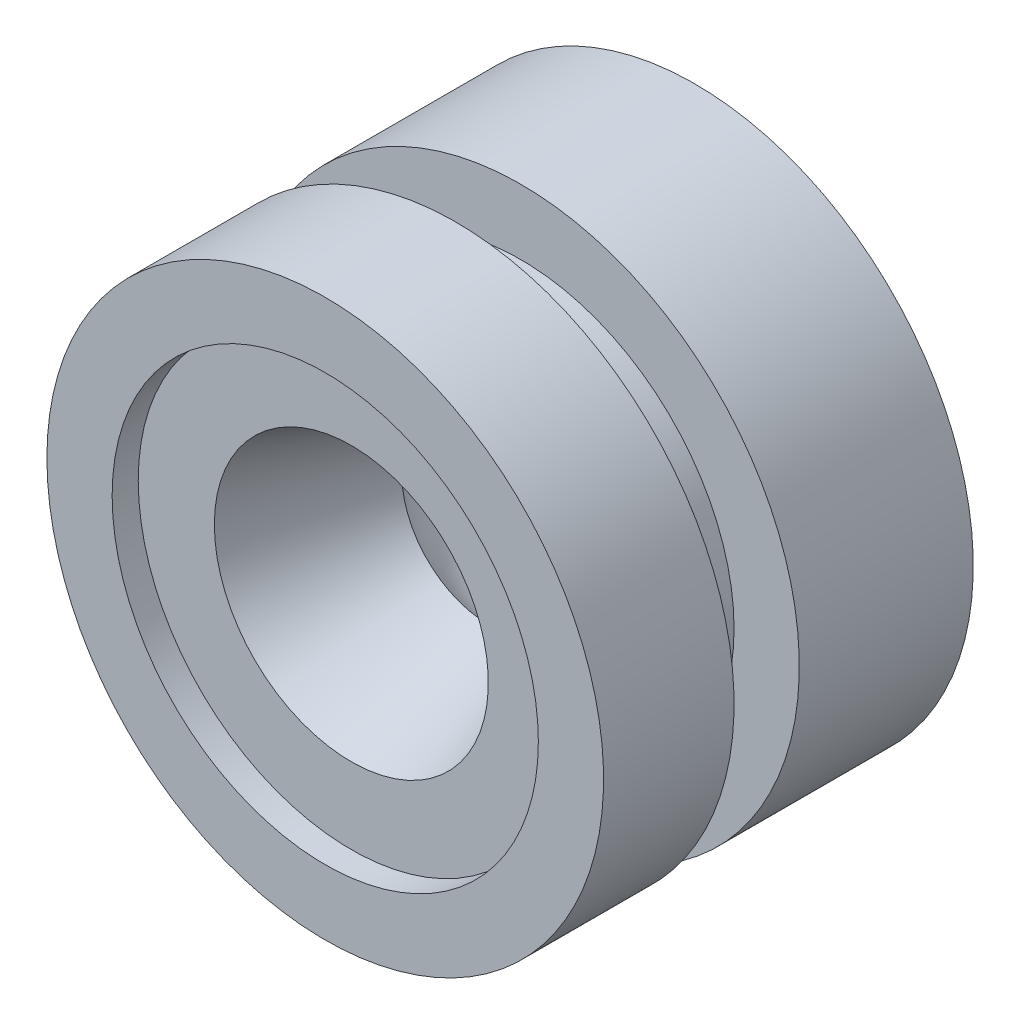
ISO-10303-21;
HEADER;
FILE_DESCRIPTION(('STEP AP214'),'2;1');
FILE_NAME('part.step','',(''),(''),'','','');
FILE_SCHEMA(('AUTOMOTIVE_DESIGN { 1 0 10303 214 1 1 1 1 }'));
ENDSEC;
DATA;
#1=APPLICATION_CONTEXT('core data for automotive mechanical design processes');
#2=APPLICATION_PROTOCOL_DEFINITION('international standard','automotive_design',2000,#1);
#3=PRODUCT_CONTEXT('',#1,'mechanical');
#4=PRODUCT('Part','Part','',(#3));
#5=PRODUCT_RELATED_PRODUCT_CATEGORY('part','',(#4));
#6=PRODUCT_DEFINITION_FORMATION('','',#4);
#7=PRODUCT_DEFINITION_CONTEXT('part definition',#1,'design');
#8=PRODUCT_DEFINITION('design','',#6,#7);
#9=PRODUCT_DEFINITION_SHAPE('','',#8);
#10=(LENGTH_UNIT() NAMED_UNIT(*) SI_UNIT(.MILLI.,.METRE.));
#11=(NAMED_UNIT(*) PLANE_ANGLE_UNIT() SI_UNIT($,.RADIAN.));
#12=(NAMED_UNIT(*) SI_UNIT($,.STERADIAN.) SOLID_ANGLE_UNIT());
#13=UNCERTAINTY_MEASURE_WITH_UNIT(LENGTH_MEASURE(1.E-05),#10,'distance_accuracy_value','');
#14=(GEOMETRIC_REPRESENTATION_CONTEXT(3) GLOBAL_UNCERTAINTY_ASSIGNED_CONTEXT((#13)) GLOBAL_UNIT_ASSIGNED_CONTEXT((#10,
#11,#12)) REPRESENTATION_CONTEXT('',''));
#15=CARTESIAN_POINT('',(0.,0.,0.));
#16=DIRECTION('',(0.,0.,1.));
#17=DIRECTION('',(1.,0.,0.));
#18=AXIS2_PLACEMENT_3D('',#15,#16,#17);
#19=CARTESIAN_POINT('',(0.,0.,-42.8402460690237));
#20=DIRECTION('',(0.,0.,-1.));
#21=DIRECTION('',(-1.,0.,0.));
#22=AXIS2_PLACEMENT_3D('',#19,#20,#21);
#23=PLANE('',#22);
#24=CARTESIAN_POINT('',(0.,0.,-42.8402460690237));
#25=DIRECTION('',(0.,0.,-1.));
#26=DIRECTION('',(-1.,0.,0.));
#27=AXIS2_PLACEMENT_3D('',#24,#25,#26);
#28=CIRCLE('',#27,3.8);
#29=CARTESIAN_POINT('',(-3.8,0.,-42.8402460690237));
#30=VERTEX_POINT('',#29);
#31=EDGE_CURVE('E10',#30,#30,#28,.T.);
#32=ORIENTED_EDGE('',*,*,#31,.T.);
#33=EDGE_LOOP('',(#32));
#34=FACE_BOUND('',#33,.T.);
#35=ADVANCED_FACE('F31',(#34),#23,.T.);
#36=CARTESIAN_POINT('',(0.,0.,-42.8402460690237));
#37=DIRECTION('',(0.,0.,-1.));
#38=DIRECTION('',(-1.,0.,0.));
#39=AXIS2_PLACEMENT_3D('',#36,#37,#38);
#40=CYLINDRICAL_SURFACE('',#39,3.8);
#41=CARTESIAN_POINT('',(0.,0.,-39.3402460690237));
#42=DIRECTION('',(0.,0.,-1.));
#43=DIRECTION('',(-1.,0.,0.));
#44=AXIS2_PLACEMENT_3D('',#41,#42,#43);
#45=CIRCLE('',#44,3.8);
#46=CARTESIAN_POINT('',(-3.8,0.,-39.3402460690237));
#47=VERTEX_POINT('',#46);
#48=EDGE_CURVE('E37',#47,#47,#45,.T.);
#49=ORIENTED_EDGE('',*,*,#48,.T.);
#50=EDGE_LOOP('',(#49));
#51=FACE_BOUND('',#50,.T.);
#52=ORIENTED_EDGE('',*,*,#31,.F.);
#53=EDGE_LOOP('',(#52));
#54=FACE_BOUND('',#53,.T.);
#55=ADVANCED_FACE('F93',(#51,#54),#40,.T.);
#56=CARTESIAN_POINT('',(-3.8,0.,-39.3402460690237));
#57=DIRECTION('',(0.,0.,-1.));
#58=DIRECTION('',(-1.,0.,0.));
#59=AXIS2_PLACEMENT_3D('',#56,#57,#58);
#60=PLANE('',#59);
#61=CARTESIAN_POINT('',(0.,0.,-39.3402460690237));
#62=DIRECTION('',(0.,0.,-1.));
#63=DIRECTION('',(-1.,0.,0.));
#64=AXIS2_PLACEMENT_3D('',#61,#62,#63);
#65=CIRCLE('',#64,5.9);
#66=CARTESIAN_POINT('',(-5.9,0.,-39.3402460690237));
#67=VERTEX_POINT('',#66);
#68=EDGE_CURVE('E41',#67,#67,#65,.T.);
#69=ORIENTED_EDGE('',*,*,#68,.T.);
#70=EDGE_LOOP('',(#69));
#71=FACE_BOUND('',#70,.T.);
#72=ORIENTED_EDGE('',*,*,#48,.F.);
#73=EDGE_LOOP('',(#72));
#74=FACE_BOUND('',#73,.T.);
#75=ADVANCED_FACE('F97',(#71,#74),#60,.T.);
#76=CARTESIAN_POINT('',(0.,0.,-42.8402460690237));
#77=DIRECTION('',(0.,0.,-1.));
#78=DIRECTION('',(-1.,0.,0.));
#79=AXIS2_PLACEMENT_3D('',#76,#77,#78);
#80=CYLINDRICAL_SURFACE('',#79,5.9);
#81=CARTESIAN_POINT('',(0.,0.,-42.8402460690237));
#82=DIRECTION('',(0.,0.,-1.));
#83=DIRECTION('',(-1.,0.,0.));
#84=AXIS2_PLACEMENT_3D('',#81,#82,#83);
#85=CIRCLE('',#84,5.9);
#86=CARTESIAN_POINT('',(-5.9,0.,-42.8402460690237));
#87=VERTEX_POINT('',#86);
#88=EDGE_CURVE('E45',#87,#87,#85,.T.);
#89=ORIENTED_EDGE('',*,*,#88,.T.);
#90=EDGE_LOOP('',(#89));
#91=FACE_BOUND('',#90,.T.);
#92=ORIENTED_EDGE('',*,*,#68,.F.);
#93=EDGE_LOOP('',(#92));
#94=FACE_BOUND('',#93,.T.);
#95=ADVANCED_FACE('F101',(#91,#94),#80,.F.);
#96=CARTESIAN_POINT('',(-5.9,0.,-42.8402460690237));
#97=DIRECTION('',(0.,0.,-1.));
#98=DIRECTION('',(-1.,0.,0.));
#99=AXIS2_PLACEMENT_3D('',#96,#97,#98);
#100=PLANE('',#99);
#101=CARTESIAN_POINT('',(0.,0.,-42.8402460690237));
#102=DIRECTION('',(0.,0.,-1.));
#103=DIRECTION('',(-1.,0.,0.));
#104=AXIS2_PLACEMENT_3D('',#101,#102,#103);
#105=CIRCLE('',#104,6.4);
#106=CARTESIAN_POINT('',(-6.4,0.,-42.8402460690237));
#107=VERTEX_POINT('',#106);
#108=EDGE_CURVE('E50',#107,#107,#105,.T.);
#109=ORIENTED_EDGE('',*,*,#108,.T.);
#110=EDGE_LOOP('',(#109));
#111=FACE_BOUND('',#110,.T.);
#112=ORIENTED_EDGE('',*,*,#88,.F.);
#113=EDGE_LOOP('',(#112));
#114=FACE_BOUND('',#113,.T.);
#115=ADVANCED_FACE('F108',(#111,#114),#100,.T.);
#116=CARTESIAN_POINT('',(0.,0.,-42.8402460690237));
#117=DIRECTION('',(0.,0.,-1.));
#118=DIRECTION('',(-1.,0.,0.));
#119=AXIS2_PLACEMENT_3D('',#116,#117,#118);
#120=CYLINDRICAL_SURFACE('',#119,6.4);
#121=CARTESIAN_POINT('',(0.,0.,-38.8402460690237));
#122=DIRECTION('',(0.,0.,-1.));
#123=DIRECTION('',(-1.,0.,0.));
#124=AXIS2_PLACEMENT_3D('',#121,#122,#123);
#125=CIRCLE('',#124,6.4);
#126=CARTESIAN_POINT('',(-6.4,0.,-38.8402460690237));
#127=VERTEX_POINT('',#126);
#128=EDGE_CURVE('E53',#127,#127,#125,.T.);
#129=ORIENTED_EDGE('',*,*,#128,.T.);
#130=EDGE_LOOP('',(#129));
#131=FACE_BOUND('',#130,.T.);
#132=ORIENTED_EDGE('',*,*,#108,.F.);
#133=EDGE_LOOP('',(#132));
#134=FACE_BOUND('',#133,.T.);
#135=ADVANCED_FACE('F112',(#131,#134),#120,.T.);
#136=CARTESIAN_POINT('',(-6.4,0.,-38.8402460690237));
#137=DIRECTION('',(0.,0.,1.));
#138=DIRECTION('',(1.,0.,0.));
#139=AXIS2_PLACEMENT_3D('',#136,#137,#138);
#140=PLANE('',#139);
#141=CARTESIAN_POINT('',(0.,0.,-38.8402460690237));
#142=DIRECTION('',(0.,0.,-1.));
#143=DIRECTION('',(-1.,0.,0.));
#144=AXIS2_PLACEMENT_3D('',#141,#142,#143);
#145=CIRCLE('',#144,4.9);
#146=CARTESIAN_POINT('',(-4.9,0.,-38.8402460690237));
#147=VERTEX_POINT('',#146);
#148=EDGE_CURVE('E56',#147,#147,#145,.T.);
#149=ORIENTED_EDGE('',*,*,#148,.T.);
#150=EDGE_LOOP('',(#149));
#151=FACE_BOUND('',#150,.T.);
#152=ORIENTED_EDGE('',*,*,#128,.F.);
#153=EDGE_LOOP('',(#152));
#154=FACE_BOUND('',#153,.T.);
#155=ADVANCED_FACE('F116',(#151,#154),#140,.T.);
#156=CARTESIAN_POINT('',(0.,0.,-42.8402460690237));
#157=DIRECTION('',(0.,0.,-1.));
#158=DIRECTION('',(-1.,0.,0.));
#159=AXIS2_PLACEMENT_3D('',#156,#157,#158);
#160=CYLINDRICAL_SURFACE('',#159,4.9);
#161=CARTESIAN_POINT('',(0.,0.,-37.3402460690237));
#162=DIRECTION('',(0.,0.,-1.));
#163=DIRECTION('',(-1.,0.,0.));
#164=AXIS2_PLACEMENT_3D('',#161,#162,#163);
#165=CIRCLE('',#164,4.9);
#166=CARTESIAN_POINT('',(-4.9,0.,-37.3402460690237));
#167=VERTEX_POINT('',#166);
#168=EDGE_CURVE('E59',#167,#167,#165,.T.);
#169=ORIENTED_EDGE('',*,*,#168,.T.);
#170=EDGE_LOOP('',(#169));
#171=FACE_BOUND('',#170,.T.);
#172=ORIENTED_EDGE('',*,*,#148,.F.);
#173=EDGE_LOOP('',(#172));
#174=FACE_BOUND('',#173,.T.);
#175=ADVANCED_FACE('F120',(#171,#174),#160,.T.);
#176=CARTESIAN_POINT('',(-4.9,0.,-37.3402460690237));
#177=DIRECTION('',(0.,0.,-1.));
#178=DIRECTION('',(-1.,0.,0.));
#179=AXIS2_PLACEMENT_3D('',#176,#177,#178);
#180=PLANE('',#179);
#181=CARTESIAN_POINT('',(0.,0.,-37.3402460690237));
#182=DIRECTION('',(0.,0.,-1.));
#183=DIRECTION('',(-1.,0.,0.));
#184=AXIS2_PLACEMENT_3D('',#181,#182,#183);
#185=CIRCLE('',#184,6.4);
#186=CARTESIAN_POINT('',(-6.4,0.,-37.3402460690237));
#187=VERTEX_POINT('',#186);
#188=EDGE_CURVE('E62',#187,#187,#185,.T.);
#189=ORIENTED_EDGE('',*,*,#188,.T.);
#190=EDGE_LOOP('',(#189));
#191=FACE_BOUND('',#190,.T.);
#192=ORIENTED_EDGE('',*,*,#168,.F.);
#193=EDGE_LOOP('',(#192));
#194=FACE_BOUND('',#193,.T.);
#195=ADVANCED_FACE('F124',(#191,#194),#180,.T.);
#196=CARTESIAN_POINT('',(0.,0.,-42.8402460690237));
#197=DIRECTION('',(0.,0.,-1.));
#198=DIRECTION('',(-1.,0.,0.));
#199=AXIS2_PLACEMENT_3D('',#196,#197,#198);
#200=CYLINDRICAL_SURFACE('',#199,6.4);
#201=CARTESIAN_POINT('',(0.,0.,-34.3402460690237));
#202=DIRECTION('',(0.,0.,-1.));
#203=DIRECTION('',(-1.,0.,0.));
#204=AXIS2_PLACEMENT_3D('',#201,#202,#203);
#205=CIRCLE('',#204,6.4);
#206=CARTESIAN_POINT('',(-6.4,0.,-34.3402460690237));
#207=VERTEX_POINT('',#206);
#208=EDGE_CURVE('E65',#207,#207,#205,.T.);
#209=ORIENTED_EDGE('',*,*,#208,.T.);
#210=EDGE_LOOP('',(#209));
#211=FACE_BOUND('',#210,.T.);
#212=ORIENTED_EDGE('',*,*,#188,.F.);
#213=EDGE_LOOP('',(#212));
#214=FACE_BOUND('',#213,.T.);
#215=ADVANCED_FACE('F128',(#211,#214),#200,.T.);
#216=CARTESIAN_POINT('',(-6.4,0.,-34.3402460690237));
#217=DIRECTION('',(0.,0.,1.));
#218=DIRECTION('',(1.,0.,0.));
#219=AXIS2_PLACEMENT_3D('',#216,#217,#218);
#220=PLANE('',#219);
#221=CARTESIAN_POINT('',(0.,0.,-34.3402460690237));
#222=DIRECTION('',(0.,0.,-1.));
#223=DIRECTION('',(-1.,0.,0.));
#224=AXIS2_PLACEMENT_3D('',#221,#222,#223);
#225=CIRCLE('',#224,4.9);
#226=CARTESIAN_POINT('',(-4.9,0.,-34.3402460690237));
#227=VERTEX_POINT('',#226);
#228=EDGE_CURVE('E68',#227,#227,#225,.T.);
#229=ORIENTED_EDGE('',*,*,#228,.T.);
#230=EDGE_LOOP('',(#229));
#231=FACE_BOUND('',#230,.T.);
#232=ORIENTED_EDGE('',*,*,#208,.F.);
#233=EDGE_LOOP('',(#232));
#234=FACE_BOUND('',#233,.T.);
#235=ADVANCED_FACE('F132',(#231,#234),#220,.T.);
#236=CARTESIAN_POINT('',(0.,0.,-42.8402460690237));
#237=DIRECTION('',(0.,0.,-1.));
#238=DIRECTION('',(-1.,0.,0.));
#239=AXIS2_PLACEMENT_3D('',#236,#237,#238);
#240=CYLINDRICAL_SURFACE('',#239,4.9);
#241=CARTESIAN_POINT('',(0.,0.,-34.9402460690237));
#242=DIRECTION('',(0.,0.,-1.));
#243=DIRECTION('',(-1.,0.,0.));
#244=AXIS2_PLACEMENT_3D('',#241,#242,#243);
#245=CIRCLE('',#244,4.9);
#246=CARTESIAN_POINT('',(-4.9,0.,-34.9402460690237));
#247=VERTEX_POINT('',#246);
#248=EDGE_CURVE('E71',#247,#247,#245,.T.);
#249=ORIENTED_EDGE('',*,*,#248,.T.);
#250=EDGE_LOOP('',(#249));
#251=FACE_BOUND('',#250,.T.);
#252=ORIENTED_EDGE('',*,*,#228,.F.);
#253=EDGE_LOOP('',(#252));
#254=FACE_BOUND('',#253,.T.);
#255=ADVANCED_FACE('F136',(#251,#254),#240,.F.);
#256=CARTESIAN_POINT('',(-4.9,0.,-34.9402460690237));
#257=DIRECTION('',(0.,0.,1.));
#258=DIRECTION('',(1.,0.,0.));
#259=AXIS2_PLACEMENT_3D('',#256,#257,#258);
#260=PLANE('',#259);
#261=CARTESIAN_POINT('',(0.,0.,-34.9402460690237));
#262=DIRECTION('',(0.,0.,-1.));
#263=DIRECTION('',(-1.,0.,0.));
#264=AXIS2_PLACEMENT_3D('',#261,#262,#263);
#265=CIRCLE('',#264,3.15);
#266=CARTESIAN_POINT('',(-3.15,0.,-34.9402460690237));
#267=VERTEX_POINT('',#266);
#268=EDGE_CURVE('E74',#267,#267,#265,.T.);
#269=ORIENTED_EDGE('',*,*,#268,.T.);
#270=EDGE_LOOP('',(#269));
#271=FACE_BOUND('',#270,.T.);
#272=ORIENTED_EDGE('',*,*,#248,.F.);
#273=EDGE_LOOP('',(#272));
#274=FACE_BOUND('',#273,.T.);
#275=ADVANCED_FACE('F90',(#271,#274),#260,.T.);
#276=CARTESIAN_POINT('',(0.,0.,-34.9402460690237));
#277=DIRECTION('',(0.,0.,1.));
#278=DIRECTION('',(1.,0.,0.));
#279=AXIS2_PLACEMENT_3D('',#276,#277,#278);
#280=CONICAL_SURFACE('',#279,3.15,0.349065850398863);
#281=CARTESIAN_POINT('',(0.,0.,-38.0998451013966));
#282=DIRECTION('',(0.,0.,-1.));
#283=DIRECTION('',(-1.,0.,0.));
#284=AXIS2_PLACEMENT_3D('',#281,#282,#283);
#285=CIRCLE('',#284,2.);
#286=CARTESIAN_POINT('',(-2.,0.,-38.0998451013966));
#287=VERTEX_POINT('',#286);
#288=EDGE_CURVE('E77',#287,#287,#285,.T.);
#289=ORIENTED_EDGE('',*,*,#288,.T.);
#290=EDGE_LOOP('',(#289));
#291=FACE_BOUND('',#290,.T.);
#292=ORIENTED_EDGE('',*,*,#268,.F.);
#293=EDGE_LOOP('',(#292));
#294=FACE_BOUND('',#293,.T.);
#295=ADVANCED_FACE('F81',(#291,#294),#280,.F.);
#296=CARTESIAN_POINT('',(0.,0.,-39.5998451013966));
#297=DIRECTION('',(0.,0.,-1.));
#298=DIRECTION('',(-1.,0.,0.));
#299=AXIS2_PLACEMENT_3D('',#296,#297,#298);
#300=SPHERICAL_SURFACE('',#299,2.5);
#301=ORIENTED_EDGE('',*,*,#288,.F.);
#302=EDGE_LOOP('',(#301));
#303=FACE_BOUND('',#302,.T.);
#304=ADVANCED_FACE('F84',(#303),#300,.F.);
#305=CLOSED_SHELL('',(#35,#55,#75,#95,#115,#135,#155,#175,#195,#215,#235,#255,#275,#295,#304));
#306=MANIFOLD_SOLID_BREP('B2',#305);
#307=ADVANCED_BREP_SHAPE_REPRESENTATION('',(#18,#306),#14);
#308=SHAPE_DEFINITION_REPRESENTATION(#9,#307);
ENDSEC;
END-ISO-10303-21;
